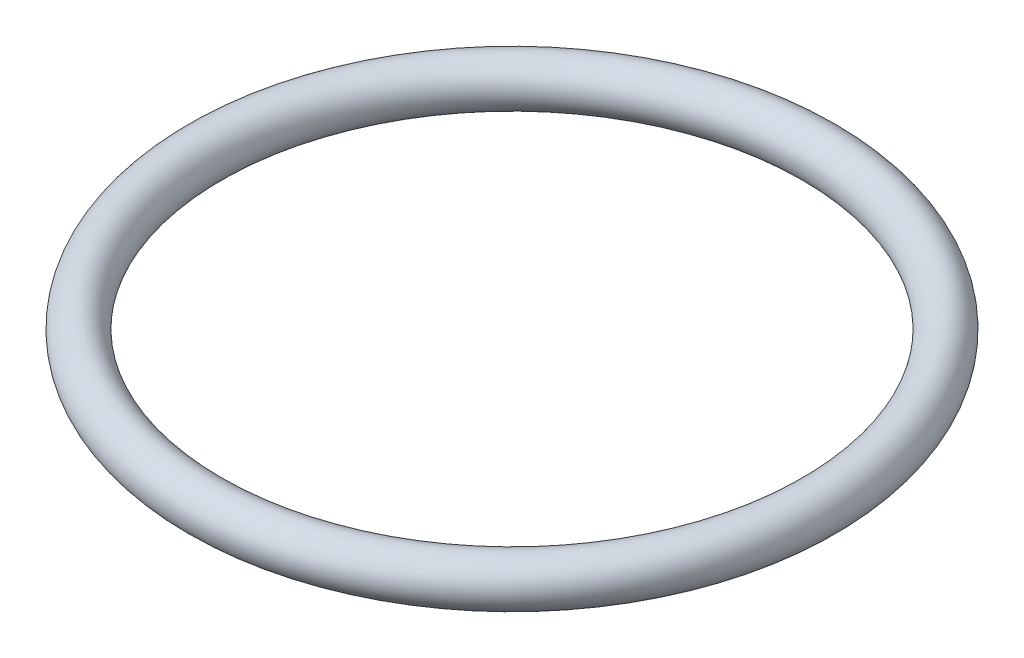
ISO-10303-21;
HEADER;
FILE_DESCRIPTION(('STEP AP214'),'2;1');
FILE_NAME('part.step','',(''),(''),'','','');
FILE_SCHEMA(('AUTOMOTIVE_DESIGN { 1 0 10303 214 1 1 1 1 }'));
ENDSEC;
DATA;
#1=APPLICATION_CONTEXT('core data for automotive mechanical design processes');
#2=APPLICATION_PROTOCOL_DEFINITION('international standard','automotive_design',2000,#1);
#3=PRODUCT_CONTEXT('',#1,'mechanical');
#4=PRODUCT('Part','Part','',(#3));
#5=PRODUCT_RELATED_PRODUCT_CATEGORY('part','',(#4));
#6=PRODUCT_DEFINITION_FORMATION('','',#4);
#7=PRODUCT_DEFINITION_CONTEXT('part definition',#1,'design');
#8=PRODUCT_DEFINITION('design','',#6,#7);
#9=PRODUCT_DEFINITION_SHAPE('','',#8);
#10=(LENGTH_UNIT() NAMED_UNIT(*) SI_UNIT(.MILLI.,.METRE.));
#11=(NAMED_UNIT(*) PLANE_ANGLE_UNIT() SI_UNIT($,.RADIAN.));
#12=(NAMED_UNIT(*) SI_UNIT($,.STERADIAN.) SOLID_ANGLE_UNIT());
#13=UNCERTAINTY_MEASURE_WITH_UNIT(LENGTH_MEASURE(1.E-05),#10,'distance_accuracy_value','');
#14=(GEOMETRIC_REPRESENTATION_CONTEXT(3) GLOBAL_UNCERTAINTY_ASSIGNED_CONTEXT((#13)) GLOBAL_UNIT_ASSIGNED_CONTEXT((#10,
#11,#12)) REPRESENTATION_CONTEXT('',''));
#15=CARTESIAN_POINT('',(0.,0.,0.));
#16=DIRECTION('',(0.,0.,1.));
#17=DIRECTION('',(1.,0.,0.));
#18=AXIS2_PLACEMENT_3D('',#15,#16,#17);
#19=CARTESIAN_POINT('',(0.,0.,0.));
#20=DIRECTION('',(0.,-1.,0.));
#21=DIRECTION('',(0.,0.,-1.));
#22=AXIS2_PLACEMENT_3D('',#19,#20,#21);
#23=TOROIDAL_SURFACE('',#22,11.8618,0.889000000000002);
#24=CARTESIAN_POINT('',(0.,0.,-12.7508));
#25=VERTEX_POINT('',#24);
#26=VERTEX_LOOP('',#25);
#27=FACE_BOUND('',#26,.T.);
#28=ADVANCED_FACE('F32',(#27),#23,.T.);
#29=CLOSED_SHELL('',(#28));
#30=MANIFOLD_SOLID_BREP('B2',#29);
#31=ADVANCED_BREP_SHAPE_REPRESENTATION('',(#18,#30),#14);
#32=SHAPE_DEFINITION_REPRESENTATION(#9,#31);
ENDSEC;
END-ISO-10303-21;
